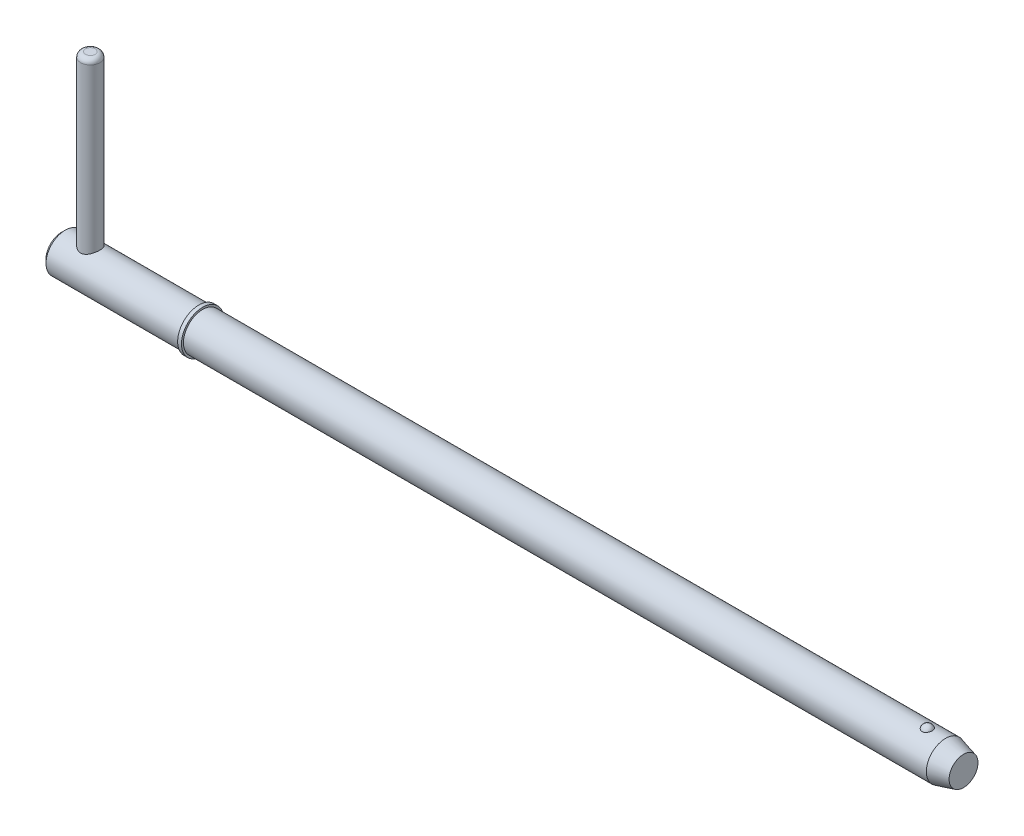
ISO-10303-21;
HEADER;
FILE_DESCRIPTION(('STEP AP214'),'2;1');
FILE_NAME('part.step','',(''),(''),'','','');
FILE_SCHEMA(('AUTOMOTIVE_DESIGN { 1 0 10303 214 1 1 1 1 }'));
ENDSEC;
DATA;
#1=APPLICATION_CONTEXT('core data for automotive mechanical design processes');
#2=APPLICATION_PROTOCOL_DEFINITION('international standard','automotive_design',2000,#1);
#3=PRODUCT_CONTEXT('',#1,'mechanical');
#4=PRODUCT('Part','Part','',(#3));
#5=PRODUCT_RELATED_PRODUCT_CATEGORY('part','',(#4));
#6=PRODUCT_DEFINITION_FORMATION('','',#4);
#7=PRODUCT_DEFINITION_CONTEXT('part definition',#1,'design');
#8=PRODUCT_DEFINITION('design','',#6,#7);
#9=PRODUCT_DEFINITION_SHAPE('','',#8);
#10=(LENGTH_UNIT() NAMED_UNIT(*) SI_UNIT(.MILLI.,.METRE.));
#11=(NAMED_UNIT(*) PLANE_ANGLE_UNIT() SI_UNIT($,.RADIAN.));
#12=(NAMED_UNIT(*) SI_UNIT($,.STERADIAN.) SOLID_ANGLE_UNIT());
#13=UNCERTAINTY_MEASURE_WITH_UNIT(LENGTH_MEASURE(1.E-05),#10,'distance_accuracy_value','');
#14=(GEOMETRIC_REPRESENTATION_CONTEXT(3) GLOBAL_UNCERTAINTY_ASSIGNED_CONTEXT((#13)) GLOBAL_UNIT_ASSIGNED_CONTEXT((#10,
#11,#12)) REPRESENTATION_CONTEXT('',''));
#15=CARTESIAN_POINT('',(0.,0.,0.));
#16=DIRECTION('',(0.,0.,1.));
#17=DIRECTION('',(1.,0.,0.));
#18=AXIS2_PLACEMENT_3D('',#15,#16,#17);
#19=CARTESIAN_POINT('',(3.57,23.02,0.));
#20=DIRECTION('',(0.,-1.,0.));
#21=DIRECTION('',(0.,0.,-1.));
#22=AXIS2_PLACEMENT_3D('',#19,#20,#21);
#23=CYLINDRICAL_SURFACE('',#22,1.19);
#24=CARTESIAN_POINT('',(3.57,-1.785,0.));
#25=DIRECTION('',(0.,1.,0.));
#26=DIRECTION('',(0.,0.,1.));
#27=AXIS2_PLACEMENT_3D('',#24,#25,#26);
#28=CIRCLE('',#27,1.19);
#29=CARTESIAN_POINT('',(3.57,-1.785,1.19));
#30=VERTEX_POINT('',#29);
#31=EDGE_CURVE('P0_E25',#30,#30,#28,.T.);
#32=ORIENTED_EDGE('',*,*,#31,.T.);
#33=EDGE_LOOP('',(#32));
#34=FACE_BOUND('',#33,.T.);
#35=CARTESIAN_POINT('',(3.57,22.425,0.));
#36=DIRECTION('',(0.,1.,0.));
#37=DIRECTION('',(0.,0.,1.));
#38=AXIS2_PLACEMENT_3D('',#35,#36,#37);
#39=CIRCLE('',#38,1.19);
#40=CARTESIAN_POINT('',(3.57,22.425,1.19));
#41=VERTEX_POINT('',#40);
#42=EDGE_CURVE('P0_E29',#41,#41,#39,.F.);
#43=ORIENTED_EDGE('',*,*,#42,.T.);
#44=EDGE_LOOP('',(#43));
#45=FACE_BOUND('',#44,.T.);
#46=ADVANCED_FACE('P0_F14',(#34,#45),#23,.T.);
#47=CARTESIAN_POINT('',(3.57,23.02,0.));
#48=DIRECTION('',(0.,1.,0.));
#49=DIRECTION('',(0.,0.,1.));
#50=AXIS2_PLACEMENT_3D('',#47,#48,#49);
#51=PLANE('',#50);
#52=CARTESIAN_POINT('',(3.57,23.02,0.));
#53=DIRECTION('',(0.,1.,0.));
#54=DIRECTION('',(0.,0.,1.));
#55=AXIS2_PLACEMENT_3D('',#52,#53,#54);
#56=CIRCLE('',#55,0.595);
#57=CARTESIAN_POINT('',(3.57,23.02,0.595));
#58=VERTEX_POINT('',#57);
#59=EDGE_CURVE('P0_E10',#58,#58,#56,.T.);
#60=ORIENTED_EDGE('',*,*,#59,.T.);
#61=EDGE_LOOP('',(#60));
#62=FACE_BOUND('',#61,.T.);
#63=ADVANCED_FACE('P0_F46',(#62),#51,.T.);
#64=CARTESIAN_POINT('',(3.57,-2.38,0.));
#65=DIRECTION('',(0.,1.,0.));
#66=DIRECTION('',(0.,0.,1.));
#67=AXIS2_PLACEMENT_3D('',#64,#65,#66);
#68=PLANE('',#67);
#69=CARTESIAN_POINT('',(3.57,-2.38,0.));
#70=DIRECTION('',(0.,1.,0.));
#71=DIRECTION('',(0.,0.,1.));
#72=AXIS2_PLACEMENT_3D('',#69,#70,#71);
#73=CIRCLE('',#72,0.595);
#74=CARTESIAN_POINT('',(3.57,-2.38,0.595));
#75=VERTEX_POINT('',#74);
#76=EDGE_CURVE('P0_E21',#75,#75,#73,.F.);
#77=ORIENTED_EDGE('',*,*,#76,.T.);
#78=EDGE_LOOP('',(#77));
#79=FACE_BOUND('',#78,.T.);
#80=ADVANCED_FACE('P0_F43',(#79),#68,.F.);
#81=CARTESIAN_POINT('',(3.57,-1.785,0.));
#82=DIRECTION('',(0.,1.,0.));
#83=DIRECTION('',(0.,0.,1.));
#84=AXIS2_PLACEMENT_3D('',#81,#82,#83);
#85=DEGENERATE_TOROIDAL_SURFACE('',#84,0.595,0.595,.T.);
#86=ORIENTED_EDGE('',*,*,#76,.F.);
#87=EDGE_LOOP('',(#86));
#88=FACE_BOUND('',#87,.T.);
#89=ORIENTED_EDGE('',*,*,#31,.F.);
#90=EDGE_LOOP('',(#89));
#91=FACE_BOUND('',#90,.T.);
#92=ADVANCED_FACE('P0_F38',(#88,#91),#85,.T.);
#93=CARTESIAN_POINT('',(3.57,22.425,0.));
#94=DIRECTION('',(0.,1.,0.));
#95=DIRECTION('',(0.,0.,1.));
#96=AXIS2_PLACEMENT_3D('',#93,#94,#95);
#97=DEGENERATE_TOROIDAL_SURFACE('',#96,0.595,0.595,.T.);
#98=ORIENTED_EDGE('',*,*,#42,.F.);
#99=EDGE_LOOP('',(#98));
#100=FACE_BOUND('',#99,.T.);
#101=ORIENTED_EDGE('',*,*,#59,.F.);
#102=EDGE_LOOP('',(#101));
#103=FACE_BOUND('',#102,.T.);
#104=ADVANCED_FACE('P0_F16',(#100,#103),#97,.T.);
#105=CLOSED_SHELL('',(#46,#63,#80,#92,#104));
#106=MANIFOLD_SOLID_BREP('P0_B1',#105);
#107=CARTESIAN_POINT('',(0.,0.,0.));
#108=DIRECTION('',(1.,0.,0.));
#109=DIRECTION('',(0.,0.,-1.));
#110=AXIS2_PLACEMENT_3D('',#107,#108,#109);
#111=CYLINDRICAL_SURFACE('',#110,2.38);
#112=CARTESIAN_POINT('',(109.209429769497,0.,0.));
#113=DIRECTION('',(1.,0.,0.));
#114=DIRECTION('',(0.,0.,-1.));
#115=AXIS2_PLACEMENT_3D('',#112,#113,#114);
#116=CIRCLE('',#115,2.38);
#117=CARTESIAN_POINT('',(109.209429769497,0.,-2.38));
#118=VERTEX_POINT('',#117);
#119=EDGE_CURVE('P1_E81',#118,#118,#116,.T.);
#120=ORIENTED_EDGE('',*,*,#119,.F.);
#121=EDGE_LOOP('',(#120));
#122=FACE_BOUND('',#121,.T.);
#123=CARTESIAN_POINT('',(17.45,0.,0.));
#124=DIRECTION('',(1.,0.,0.));
#125=DIRECTION('',(0.,0.,-1.));
#126=AXIS2_PLACEMENT_3D('',#123,#124,#125);
#127=CIRCLE('',#126,2.38);
#128=CARTESIAN_POINT('',(17.45,0.,-2.38));
#129=VERTEX_POINT('',#128);
#130=EDGE_CURVE('P1_E85',#129,#129,#127,.T.);
#131=ORIENTED_EDGE('',*,*,#130,.T.);
#132=EDGE_LOOP('',(#131));
#133=FACE_BOUND('',#132,.T.);
#134=CARTESIAN_POINT('',(106.963449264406,2.2921568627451,0.640637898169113));
#135=CARTESIAN_POINT('',(106.930355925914,2.29215737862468,0.64063719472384));
#136=CARTESIAN_POINT('',(106.897254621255,2.29293179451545,0.637884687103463));
#137=CARTESIAN_POINT('',(106.832017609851,2.29594030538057,0.626968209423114));
#138=CARTESIAN_POINT('',(106.799882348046,2.29817506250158,0.618801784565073));
#139=CARTESIAN_POINT('',(106.737540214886,2.3038430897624,0.597351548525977));
#140=CARTESIAN_POINT('',(106.70733051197,2.30727454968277,0.584075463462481));
#141=CARTESIAN_POINT('',(106.649567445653,2.31495941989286,0.552829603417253));
#142=CARTESIAN_POINT('',(106.62201418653,2.31921286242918,0.534859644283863));
#143=CARTESIAN_POINT('',(106.569593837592,2.32820213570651,0.494282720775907));
#144=CARTESIAN_POINT('',(106.544805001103,2.33294694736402,0.471576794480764));
#145=CARTESIAN_POINT('',(106.499216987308,2.34234144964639,0.422446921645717));
#146=CARTESIAN_POINT('',(106.478418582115,2.34699112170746,0.396022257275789));
#147=CARTESIAN_POINT('',(106.44035804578,2.35593942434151,0.33885587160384));
#148=CARTESIAN_POINT('',(106.423305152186,2.36021170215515,0.307970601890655));
#149=CARTESIAN_POINT('',(106.3943607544,2.3677057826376,0.243750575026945));
#150=CARTESIAN_POINT('',(106.3824701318,2.37092740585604,0.210415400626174));
#151=CARTESIAN_POINT('',(106.363807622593,2.37606901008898,0.141189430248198));
#152=CARTESIAN_POINT('',(106.357195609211,2.37794816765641,0.105252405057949));
#153=CARTESIAN_POINT('',(106.349809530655,2.38005135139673,0.0327351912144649));
#154=CARTESIAN_POINT('',(106.349035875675,2.38027526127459,-0.00384504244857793));
#155=CARTESIAN_POINT('',(106.353362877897,2.37903842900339,-0.0769838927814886));
#156=CARTESIAN_POINT('',(106.35852028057,2.37756141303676,-0.113538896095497));
#157=CARTESIAN_POINT('',(106.374701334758,2.37305303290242,-0.185229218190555));
#158=CARTESIAN_POINT('',(106.385725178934,2.37002161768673,-0.220364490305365));
#159=CARTESIAN_POINT('',(106.413397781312,2.36273722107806,-0.288156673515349));
#160=CARTESIAN_POINT('',(106.430038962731,2.35848588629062,-0.320816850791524));
#161=CARTESIAN_POINT('',(106.468598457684,2.34923130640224,-0.382744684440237));
#162=CARTESIAN_POINT('',(106.490516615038,2.34422808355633,-0.412012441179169));
#163=CARTESIAN_POINT('',(106.538754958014,2.33412555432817,-0.465830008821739));
#164=CARTESIAN_POINT('',(106.565002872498,2.32902887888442,-0.490444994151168));
#165=CARTESIAN_POINT('',(106.621476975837,2.31926941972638,-0.534700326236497));
#166=CARTESIAN_POINT('',(106.651702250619,2.3146065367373,-0.554341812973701));
#167=CARTESIAN_POINT('',(106.714061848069,2.30645675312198,-0.587312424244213));
#168=CARTESIAN_POINT('',(106.746078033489,2.30293152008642,-0.600855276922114));
#169=CARTESIAN_POINT('',(106.812079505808,2.29725171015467,-0.622220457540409));
#170=CARTESIAN_POINT('',(106.846064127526,2.29509667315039,-0.630044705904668));
#171=CARTESIAN_POINT('',(106.913299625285,2.29249264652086,-0.639452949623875));
#172=CARTESIAN_POINT('',(106.946508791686,2.29196755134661,-0.641315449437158));
#173=CARTESIAN_POINT('',(107.012763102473,2.29246849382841,-0.63952261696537));
#174=CARTESIAN_POINT('',(107.045808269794,2.29349430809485,-0.635868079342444));
#175=CARTESIAN_POINT('',(107.110102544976,2.29694059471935,-0.623301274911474));
#176=CARTESIAN_POINT('',(107.141374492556,2.29933234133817,-0.614497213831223));
#177=CARTESIAN_POINT('',(107.201995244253,2.30522511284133,-0.592006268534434));
#178=CARTESIAN_POINT('',(107.231343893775,2.30872622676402,-0.578318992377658));
#179=CARTESIAN_POINT('',(107.288036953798,2.31655795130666,-0.546112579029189));
#180=CARTESIAN_POINT('',(107.315320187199,2.32090569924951,-0.52749010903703));
#181=CARTESIAN_POINT('',(107.366490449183,2.3299220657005,-0.486117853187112));
#182=CARTESIAN_POINT('',(107.390376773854,2.33459075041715,-0.463367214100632));
#183=CARTESIAN_POINT('',(107.435272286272,2.34399834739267,-0.41322006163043));
#184=CARTESIAN_POINT('',(107.456097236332,2.34873051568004,-0.38565730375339));
#185=CARTESIAN_POINT('',(107.493056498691,2.35754932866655,-0.327455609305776));
#186=CARTESIAN_POINT('',(107.509189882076,2.36163584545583,-0.296816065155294));
#187=CARTESIAN_POINT('',(107.5369822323,2.36889321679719,-0.232047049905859));
#188=CARTESIAN_POINT('',(107.548445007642,2.37202275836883,-0.197828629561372));
#189=CARTESIAN_POINT('',(107.565752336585,2.37681926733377,-0.127900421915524));
#190=CARTESIAN_POINT('',(107.571596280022,2.37848607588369,-0.092190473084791));
#191=CARTESIAN_POINT('',(107.577605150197,2.38020024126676,-0.0196348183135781));
#192=CARTESIAN_POINT('',(107.57767043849,2.38021918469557,0.0172198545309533));
#193=CARTESIAN_POINT('',(107.571868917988,2.37856356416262,0.0904219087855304));
#194=CARTESIAN_POINT('',(107.566001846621,2.37688892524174,0.126769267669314));
#195=CARTESIAN_POINT('',(107.548425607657,2.37201688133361,0.198028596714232));
#196=CARTESIAN_POINT('',(107.536699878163,2.36881516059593,0.232936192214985));
#197=CARTESIAN_POINT('',(107.50763544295,2.36123444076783,0.300196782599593));
#198=CARTESIAN_POINT('',(107.490296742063,2.3568554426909,0.332549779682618));
#199=CARTESIAN_POINT('',(107.450535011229,2.34744667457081,0.39349541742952));
#200=CARTESIAN_POINT('',(107.428152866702,2.34242227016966,0.422115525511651));
#201=CARTESIAN_POINT('',(107.378739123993,2.33227293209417,0.475004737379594));
#202=CARTESIAN_POINT('',(107.351707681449,2.32714800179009,0.499273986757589));
#203=CARTESIAN_POINT('',(107.294498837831,2.31755359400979,0.542046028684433));
#204=CARTESIAN_POINT('',(107.26442973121,2.3130698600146,0.560690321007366));
#205=CARTESIAN_POINT('',(107.201386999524,2.30514125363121,0.592447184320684));
#206=CARTESIAN_POINT('',(107.168415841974,2.30169550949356,0.605564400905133));
#207=CARTESIAN_POINT('',(107.106842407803,2.29677744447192,0.623927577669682));
#208=CARTESIAN_POINT('',(107.078555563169,2.295058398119,0.630178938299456));
#209=CARTESIAN_POINT('',(107.021330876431,2.29274795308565,0.638534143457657));
#210=CARTESIAN_POINT('',(106.992393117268,2.29215641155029,0.640638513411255));
#211=CARTESIAN_POINT('',(106.963449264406,2.2921568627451,0.640637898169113));
#212=B_SPLINE_CURVE_WITH_KNOTS('',3,(#134,#135,#136,#137,#138,#139,#140,#141,#142,#143,#144,
#145,#146,#147,#148,#149,#150,#151,#152,#153,#154,#155,#156,#157,#158,#159,#160,#161,#162,#163,
#164,#165,#166,#167,#168,#169,#170,#171,#172,#173,#174,#175,#176,#177,#178,#179,#180,#181,#182,
#183,#184,#185,#186,#187,#188,#189,#190,#191,#192,#193,#194,#195,#196,#197,#198,#199,#200,#201,
#202,#203,#204,#205,#206,#207,#208,#209,#210,#211),.UNSPECIFIED.,.T.,.F.,(4,2,2,2,2,2,2,2,2,2,2,
2,2,2,2,2,2,2,2,2,2,2,2,2,2,2,2,2,2,2,2,2,2,2,2,2,2,2,4),(0.,0.0991724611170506,
0.198389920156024,0.297457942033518,0.396529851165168,0.497927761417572,0.59934527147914,
0.705475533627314,0.811623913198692,0.920876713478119,1.03013718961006,1.14045177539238,
1.25076998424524,1.36093998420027,1.47110672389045,1.57959248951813,1.68805336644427,
1.79234266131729,1.89659691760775,1.9959039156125,2.09519661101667,2.19247425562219,
2.2897597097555,2.38926978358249,2.48880044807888,2.59293588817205,2.69709193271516,
2.80525821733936,2.91343624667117,3.0234791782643,3.13352698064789,3.24388765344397,
3.35424823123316,3.46374443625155,3.5732369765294,3.67968690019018,3.78604717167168,
3.87279565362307,3.9595331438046),.UNSPECIFIED.);
#213=CARTESIAN_POINT('',(106.963449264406,2.2921568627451,0.640637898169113));
#214=VERTEX_POINT('',#213);
#215=EDGE_CURVE('P1_E35',#214,#214,#212,.T.);
#216=ORIENTED_EDGE('',*,*,#215,.T.);
#217=EDGE_LOOP('',(#216));
#218=FACE_BOUND('',#217,.T.);
#219=ADVANCED_FACE('P1_F13',(#122,#133,#218),#111,.T.);
#220=CARTESIAN_POINT('',(0.,0.,0.));
#221=DIRECTION('',(-1.,0.,0.));
#222=DIRECTION('',(0.,0.,1.));
#223=AXIS2_PLACEMENT_3D('',#220,#221,#222);
#224=PLANE('',#223);
#225=CARTESIAN_POINT('',(0.,0.,0.));
#226=DIRECTION('',(1.,0.,0.));
#227=DIRECTION('',(0.,0.,-1.));
#228=AXIS2_PLACEMENT_3D('',#225,#226,#227);
#229=CIRCLE('',#228,1.904);
#230=CARTESIAN_POINT('',(0.,0.,-1.904));
#231=VERTEX_POINT('',#230);
#232=EDGE_CURVE('P1_E9',#231,#231,#229,.T.);
#233=ORIENTED_EDGE('',*,*,#232,.F.);
#234=EDGE_LOOP('',(#233));
#235=FACE_BOUND('',#234,.T.);
#236=ADVANCED_FACE('P1_F15',(#235),#224,.T.);
#237=CARTESIAN_POINT('',(0.475999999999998,0.,0.));
#238=DIRECTION('',(1.,0.,0.));
#239=DIRECTION('',(0.,0.,-1.));
#240=AXIS2_PLACEMENT_3D('',#237,#238,#239);
#241=CONICAL_SURFACE('',#240,2.38,0.78539816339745);
#242=ORIENTED_EDGE('',*,*,#232,.T.);
#243=EDGE_LOOP('',(#242));
#244=FACE_BOUND('',#243,.T.);
#245=CARTESIAN_POINT('',(0.475999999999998,0.,0.));
#246=DIRECTION('',(1.,0.,0.));
#247=DIRECTION('',(0.,0.,-1.));
#248=AXIS2_PLACEMENT_3D('',#245,#246,#247);
#249=CIRCLE('',#248,2.38);
#250=CARTESIAN_POINT('',(0.475999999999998,0.,-2.38));
#251=VERTEX_POINT('',#250);
#252=EDGE_CURVE('P1_E26',#251,#251,#249,.T.);
#253=ORIENTED_EDGE('',*,*,#252,.F.);
#254=EDGE_LOOP('',(#253));
#255=FACE_BOUND('',#254,.T.);
#256=ADVANCED_FACE('P1_F77',(#244,#255),#241,.T.);
#257=CARTESIAN_POINT('',(0.,0.,0.));
#258=DIRECTION('',(1.,0.,0.));
#259=DIRECTION('',(0.,0.,-1.));
#260=AXIS2_PLACEMENT_3D('',#257,#258,#259);
#261=CYLINDRICAL_SURFACE('',#260,2.38);
#262=CARTESIAN_POINT('',(3.57,-2.06114046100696,1.19));
#263=CARTESIAN_POINT('',(3.50799170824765,-2.06114586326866,1.18999567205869));
#264=CARTESIAN_POINT('',(3.4459051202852,-2.0639812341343,1.18512096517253));
#265=CARTESIAN_POINT('',(3.32363755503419,-2.07491216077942,1.16587061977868));
#266=CARTESIAN_POINT('',(3.26346086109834,-2.08301876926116,1.15147501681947));
#267=CARTESIAN_POINT('',(3.14701251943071,-2.10331722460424,1.11395893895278));
#268=CARTESIAN_POINT('',(3.09072196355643,-2.1154873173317,1.09088484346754));
#269=CARTESIAN_POINT('',(2.9828251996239,-2.14250771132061,1.03680835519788));
#270=CARTESIAN_POINT('',(2.93121924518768,-2.15735815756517,1.00580553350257));
#271=CARTESIAN_POINT('',(2.82945618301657,-2.18956274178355,0.933753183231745));
#272=CARTESIAN_POINT('',(2.77976962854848,-2.20702235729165,0.892085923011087));
#273=CARTESIAN_POINT('',(2.68772401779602,-2.2416265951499,0.801172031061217));
#274=CARTESIAN_POINT('',(2.64536861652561,-2.25877105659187,0.751921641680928));
#275=CARTESIAN_POINT('',(2.56639309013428,-2.29219557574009,0.64318258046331));
#276=CARTESIAN_POINT('',(2.53035201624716,-2.30833946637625,0.583227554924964));
#277=CARTESIAN_POINT('',(2.46908238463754,-2.3365739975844,0.45714686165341));
#278=CARTESIAN_POINT('',(2.44384700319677,-2.34866719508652,0.391025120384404));
#279=CARTESIAN_POINT('',(2.40676945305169,-2.36667748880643,0.259473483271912));
#280=CARTESIAN_POINT('',(2.39410206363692,-2.37297281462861,0.194329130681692));
#281=CARTESIAN_POINT('',(2.3798023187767,-2.3800902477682,0.0625590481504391));
#282=CARTESIAN_POINT('',(2.37816328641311,-2.38091566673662,-0.00406576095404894));
#283=CARTESIAN_POINT('',(2.38564854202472,-2.37717948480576,-0.130700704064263));
#284=CARTESIAN_POINT('',(2.39384923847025,-2.37308010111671,-0.190782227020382));
#285=CARTESIAN_POINT('',(2.41912820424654,-2.360653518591,-0.308583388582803));
#286=CARTESIAN_POINT('',(2.43620713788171,-2.35232600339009,-0.366302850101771));
#287=CARTESIAN_POINT('',(2.47886825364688,-2.33206184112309,-0.478748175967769));
#288=CARTESIAN_POINT('',(2.50456481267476,-2.32007685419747,-0.533421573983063));
#289=CARTESIAN_POINT('',(2.56357346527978,-2.29357798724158,-0.637812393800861));
#290=CARTESIAN_POINT('',(2.5968882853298,-2.27906320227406,-0.687528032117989));
#291=CARTESIAN_POINT('',(2.67380546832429,-2.24724829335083,-0.785606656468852));
#292=CARTESIAN_POINT('',(2.71808260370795,-2.22981457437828,-0.833397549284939));
#293=CARTESIAN_POINT('',(2.81386177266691,-2.19500665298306,-0.921184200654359));
#294=CARTESIAN_POINT('',(2.86536931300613,-2.17763250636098,-0.961173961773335));
#295=CARTESIAN_POINT('',(2.97815134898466,-2.14371545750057,-1.03471134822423));
#296=CARTESIAN_POINT('',(3.03983836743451,-2.12729540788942,-1.06768860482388));
#297=CARTESIAN_POINT('',(3.16889582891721,-2.09886785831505,-1.12254974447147));
#298=CARTESIAN_POINT('',(3.2362602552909,-2.0868557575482,-1.14444520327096));
#299=CARTESIAN_POINT('',(3.36914526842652,-2.06994116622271,-1.1747444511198));
#300=CARTESIAN_POINT('',(3.43438893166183,-2.06455070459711,-1.18407989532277));
#301=CARTESIAN_POINT('',(3.56571759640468,-2.06010324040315,-1.1918051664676));
#302=CARTESIAN_POINT('',(3.63180197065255,-2.06104176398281,-1.19020272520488));
#303=CARTESIAN_POINT('',(3.75522816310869,-2.06862860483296,-1.17695289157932));
#304=CARTESIAN_POINT('',(3.81273554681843,-2.07464109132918,-1.16642350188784));
#305=CARTESIAN_POINT('',(3.92505766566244,-2.09075885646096,-1.1372785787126));
#306=CARTESIAN_POINT('',(3.97987152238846,-2.1008654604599,-1.1186604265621));
#307=CARTESIAN_POINT('',(4.08813948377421,-2.12458104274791,-1.07296063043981));
#308=CARTESIAN_POINT('',(4.14141303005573,-2.13833055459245,-1.04552693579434));
#309=CARTESIAN_POINT('',(4.2429084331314,-2.16765782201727,-0.983281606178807));
#310=CARTESIAN_POINT('',(4.29112767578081,-2.18323651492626,-0.948466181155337));
#311=CARTESIAN_POINT('',(4.38750473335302,-2.2168271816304,-0.867316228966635));
#312=CARTESIAN_POINT('',(4.43488860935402,-2.23489833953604,-0.82008287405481));
#313=CARTESIAN_POINT('',(4.52130056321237,-2.26973739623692,-0.718051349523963));
#314=CARTESIAN_POINT('',(4.56032581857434,-2.28650485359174,-0.663250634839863));
#315=CARTESIAN_POINT('',(4.62978273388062,-2.31742220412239,-0.545657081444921));
#316=CARTESIAN_POINT('',(4.65996041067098,-2.33149133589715,-0.482691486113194));
#317=CARTESIAN_POINT('',(4.7089941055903,-2.35481192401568,-0.351671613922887));
#318=CARTESIAN_POINT('',(4.7278600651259,-2.36406760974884,-0.283621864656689));
#319=CARTESIAN_POINT('',(4.75210859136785,-2.3760433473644,-0.151105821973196));
#320=CARTESIAN_POINT('',(4.75856947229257,-2.37928514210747,-0.0868836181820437));
#321=CARTESIAN_POINT('',(4.76100348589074,-2.38050135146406,0.0417999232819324));
#322=CARTESIAN_POINT('',(4.75698028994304,-2.37847760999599,0.106261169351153));
#323=CARTESIAN_POINT('',(4.73927447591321,-2.36969422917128,0.229120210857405));
#324=CARTESIAN_POINT('',(4.72624582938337,-2.36325544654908,0.287637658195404));
#325=CARTESIAN_POINT('',(4.69178087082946,-2.34658591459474,0.401560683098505));
#326=CARTESIAN_POINT('',(4.67034335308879,-2.33635462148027,0.456965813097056));
#327=CARTESIAN_POINT('',(4.61871480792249,-2.31247857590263,0.565753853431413));
#328=CARTESIAN_POINT('',(4.58818860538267,-2.29870654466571,0.618948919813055));
#329=CARTESIAN_POINT('',(4.51967006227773,-2.26918878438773,0.719681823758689));
#330=CARTESIAN_POINT('',(4.48167429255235,-2.25344215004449,0.76721704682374));
#331=CARTESIAN_POINT('',(4.39491140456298,-2.21969046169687,0.860267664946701));
#332=CARTESIAN_POINT('',(4.34544863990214,-2.20161660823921,0.905111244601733));
#333=CARTESIAN_POINT('',(4.23943364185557,-2.16655060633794,0.986109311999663));
#334=CARTESIAN_POINT('',(4.18287520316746,-2.1495594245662,1.02225611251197));
#335=CARTESIAN_POINT('',(4.06190239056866,-2.1181953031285,1.08579298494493));
#336=CARTESIAN_POINT('',(3.9972962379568,-2.10392207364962,1.11287022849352));
#337=CARTESIAN_POINT('',(3.86353443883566,-2.08090726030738,1.15534566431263));
#338=CARTESIAN_POINT('',(3.7943948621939,-2.07214719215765,1.17078291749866));
#339=CARTESIAN_POINT('',(3.69875162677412,-2.06499834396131,1.18329673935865));
#340=CARTESIAN_POINT('',(3.67309220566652,-2.06355673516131,1.18580656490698));
#341=CARTESIAN_POINT('',(3.62162638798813,-2.06162663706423,1.18915915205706));
#342=CARTESIAN_POINT('',(3.59581998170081,-2.0611382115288,1.19000180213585));
#343=CARTESIAN_POINT('',(3.57,-2.06114046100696,1.19));
#344=B_SPLINE_CURVE_WITH_KNOTS('',3,(#262,#263,#264,#265,#266,#267,#268,#269,#270,#271,#272,
#273,#274,#275,#276,#277,#278,#279,#280,#281,#282,#283,#284,#285,#286,#287,#288,#289,#290,#291,
#292,#293,#294,#295,#296,#297,#298,#299,#300,#301,#302,#303,#304,#305,#306,#307,#308,#309,#310,
#311,#312,#313,#314,#315,#316,#317,#318,#319,#320,#321,#322,#323,#324,#325,#326,#327,#328,#329,
#330,#331,#332,#333,#334,#335,#336,#337,#338,#339,#340,#341,#342,#343),.UNSPECIFIED.,.T.,.F.,(4,
2,2,2,2,2,2,2,2,2,2,2,2,2,2,2,2,2,2,2,2,2,2,2,2,2,2,2,2,2,2,2,2,2,2,2,2,2,2,2,4),(0.,
0.185916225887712,0.372223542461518,0.557549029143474,0.742884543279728,0.943506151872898,
1.14422749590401,1.35847891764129,1.5725948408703,1.77147547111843,1.97023568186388,
2.15171156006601,2.33320101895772,2.51720146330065,2.70126786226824,2.902733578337,
3.10435357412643,3.31877721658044,3.53297641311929,3.73020126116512,3.92728670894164,
4.1028127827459,4.27839572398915,4.46211082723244,4.64592048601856,4.8529002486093,
5.0599497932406,5.27246375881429,5.48479067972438,5.67763601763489,5.87041383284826,
6.05048865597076,6.23058930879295,6.41839293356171,6.60628297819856,6.8128718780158,
7.01964271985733,7.2329479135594,7.44553408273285,7.52294360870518,7.60035831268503),.UNSPECIFIED.);
#345=CARTESIAN_POINT('',(3.57,-2.06114046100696,1.19));
#346=VERTEX_POINT('',#345);
#347=EDGE_CURVE('P1_E17',#346,#346,#344,.T.);
#348=ORIENTED_EDGE('',*,*,#347,.F.);
#349=EDGE_LOOP('',(#348));
#350=FACE_BOUND('',#349,.T.);
#351=CARTESIAN_POINT('',(3.57,2.06114046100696,1.19));
#352=CARTESIAN_POINT('',(3.63200829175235,2.06114586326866,1.18999567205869));
#353=CARTESIAN_POINT('',(3.6940948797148,2.0639812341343,1.18512096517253));
#354=CARTESIAN_POINT('',(3.81636244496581,2.07491216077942,1.16587061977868));
#355=CARTESIAN_POINT('',(3.87653913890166,2.08301876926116,1.15147501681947));
#356=CARTESIAN_POINT('',(3.99298748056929,2.10331722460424,1.11395893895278));
#357=CARTESIAN_POINT('',(4.04927803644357,2.1154873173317,1.09088484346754));
#358=CARTESIAN_POINT('',(4.1571748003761,2.14250771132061,1.03680835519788));
#359=CARTESIAN_POINT('',(4.20878075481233,2.15735815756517,1.00580553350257));
#360=CARTESIAN_POINT('',(4.31054381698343,2.18956274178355,0.933753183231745));
#361=CARTESIAN_POINT('',(4.36023037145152,2.20702235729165,0.892085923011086));
#362=CARTESIAN_POINT('',(4.45227598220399,2.2416265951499,0.801172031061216));
#363=CARTESIAN_POINT('',(4.49463138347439,2.25877105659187,0.751921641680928));
#364=CARTESIAN_POINT('',(4.57360690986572,2.29219557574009,0.643182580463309));
#365=CARTESIAN_POINT('',(4.60964798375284,2.30833946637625,0.583227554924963));
#366=CARTESIAN_POINT('',(4.67091761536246,2.3365739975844,0.457146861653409));
#367=CARTESIAN_POINT('',(4.69615299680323,2.34866719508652,0.391025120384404));
#368=CARTESIAN_POINT('',(4.73323054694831,2.36667748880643,0.259473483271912));
#369=CARTESIAN_POINT('',(4.74589793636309,2.37297281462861,0.194329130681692));
#370=CARTESIAN_POINT('',(4.7601976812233,2.3800902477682,0.0625590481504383));
#371=CARTESIAN_POINT('',(4.76183671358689,2.38091566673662,-0.00406576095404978));
#372=CARTESIAN_POINT('',(4.75435145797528,2.37717948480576,-0.130700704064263));
#373=CARTESIAN_POINT('',(4.74615076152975,2.37308010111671,-0.190782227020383));
#374=CARTESIAN_POINT('',(4.72087179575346,2.360653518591,-0.308583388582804));
#375=CARTESIAN_POINT('',(4.70379286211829,2.35232600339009,-0.366302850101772));
#376=CARTESIAN_POINT('',(4.66113174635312,2.33206184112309,-0.478748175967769));
#377=CARTESIAN_POINT('',(4.63543518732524,2.32007685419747,-0.533421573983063));
#378=CARTESIAN_POINT('',(4.57642653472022,2.29357798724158,-0.637812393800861));
#379=CARTESIAN_POINT('',(4.5431117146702,2.27906320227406,-0.687528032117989));
#380=CARTESIAN_POINT('',(4.46619453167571,2.24724829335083,-0.785606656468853));
#381=CARTESIAN_POINT('',(4.42191739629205,2.22981457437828,-0.83339754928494));
#382=CARTESIAN_POINT('',(4.32613822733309,2.19500665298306,-0.921184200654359));
#383=CARTESIAN_POINT('',(4.27463068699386,2.17763250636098,-0.961173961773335));
#384=CARTESIAN_POINT('',(4.16184865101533,2.14371545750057,-1.03471134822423));
#385=CARTESIAN_POINT('',(4.10016163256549,2.12729540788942,-1.06768860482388));
#386=CARTESIAN_POINT('',(3.97110417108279,2.09886785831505,-1.12254974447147));
#387=CARTESIAN_POINT('',(3.9037397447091,2.0868557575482,-1.14444520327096));
#388=CARTESIAN_POINT('',(3.77085473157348,2.06994116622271,-1.1747444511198));
#389=CARTESIAN_POINT('',(3.70561106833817,2.06455070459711,-1.18407989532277));
#390=CARTESIAN_POINT('',(3.57428240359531,2.06010324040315,-1.1918051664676));
#391=CARTESIAN_POINT('',(3.50819802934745,2.06104176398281,-1.19020272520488));
#392=CARTESIAN_POINT('',(3.38477183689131,2.06862860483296,-1.17695289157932));
#393=CARTESIAN_POINT('',(3.32726445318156,2.07464109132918,-1.16642350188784));
#394=CARTESIAN_POINT('',(3.21494233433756,2.09075885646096,-1.1372785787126));
#395=CARTESIAN_POINT('',(3.16012847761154,2.1008654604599,-1.1186604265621));
#396=CARTESIAN_POINT('',(3.05186051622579,2.12458104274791,-1.07296063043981));
#397=CARTESIAN_POINT('',(2.99858696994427,2.13833055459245,-1.04552693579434));
#398=CARTESIAN_POINT('',(2.8970915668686,2.16765782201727,-0.983281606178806));
#399=CARTESIAN_POINT('',(2.84887232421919,2.18323651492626,-0.948466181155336));
#400=CARTESIAN_POINT('',(2.75249526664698,2.2168271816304,-0.867316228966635));
#401=CARTESIAN_POINT('',(2.70511139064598,2.23489833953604,-0.820082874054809));
#402=CARTESIAN_POINT('',(2.61869943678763,2.26973739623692,-0.718051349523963));
#403=CARTESIAN_POINT('',(2.57967418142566,2.28650485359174,-0.663250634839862));
#404=CARTESIAN_POINT('',(2.51021726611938,2.31742220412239,-0.54565708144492));
#405=CARTESIAN_POINT('',(2.48003958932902,2.33149133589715,-0.482691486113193));
#406=CARTESIAN_POINT('',(2.4310058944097,2.35481192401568,-0.351671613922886));
#407=CARTESIAN_POINT('',(2.4121399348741,2.36406760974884,-0.283621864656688));
#408=CARTESIAN_POINT('',(2.38789140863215,2.3760433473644,-0.151105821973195));
#409=CARTESIAN_POINT('',(2.38143052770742,2.37928514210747,-0.0868836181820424));
#410=CARTESIAN_POINT('',(2.37899651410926,2.38050135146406,0.0417999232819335));
#411=CARTESIAN_POINT('',(2.38301971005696,2.37847760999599,0.106261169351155));
#412=CARTESIAN_POINT('',(2.40072552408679,2.36969422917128,0.229120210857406));
#413=CARTESIAN_POINT('',(2.41375417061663,2.36325544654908,0.287637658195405));
#414=CARTESIAN_POINT('',(2.44821912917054,2.34658591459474,0.401560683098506));
#415=CARTESIAN_POINT('',(2.46965664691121,2.33635462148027,0.456965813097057));
#416=CARTESIAN_POINT('',(2.52128519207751,2.31247857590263,0.565753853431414));
#417=CARTESIAN_POINT('',(2.55181139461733,2.29870654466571,0.618948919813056));
#418=CARTESIAN_POINT('',(2.62032993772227,2.26918878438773,0.719681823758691));
#419=CARTESIAN_POINT('',(2.65832570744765,2.25344215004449,0.767217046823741));
#420=CARTESIAN_POINT('',(2.74508859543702,2.21969046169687,0.860267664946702));
#421=CARTESIAN_POINT('',(2.79455136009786,2.20161660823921,0.905111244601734));
#422=CARTESIAN_POINT('',(2.90056635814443,2.16655060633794,0.986109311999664));
#423=CARTESIAN_POINT('',(2.95712479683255,2.1495594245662,1.02225611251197));
#424=CARTESIAN_POINT('',(3.07809760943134,2.1181953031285,1.08579298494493));
#425=CARTESIAN_POINT('',(3.1427037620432,2.10392207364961,1.11287022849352));
#426=CARTESIAN_POINT('',(3.27646556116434,2.08090726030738,1.15534566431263));
#427=CARTESIAN_POINT('',(3.3456051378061,2.07214719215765,1.17078291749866));
#428=CARTESIAN_POINT('',(3.44124837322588,2.06499834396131,1.18329673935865));
#429=CARTESIAN_POINT('',(3.46690779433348,2.06355673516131,1.18580656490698));
#430=CARTESIAN_POINT('',(3.51837361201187,2.06162663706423,1.18915915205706));
#431=CARTESIAN_POINT('',(3.54418001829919,2.0611382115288,1.19000180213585));
#432=CARTESIAN_POINT('',(3.57,2.06114046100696,1.19));
#433=B_SPLINE_CURVE_WITH_KNOTS('',3,(#351,#352,#353,#354,#355,#356,#357,#358,#359,#360,#361,
#362,#363,#364,#365,#366,#367,#368,#369,#370,#371,#372,#373,#374,#375,#376,#377,#378,#379,#380,
#381,#382,#383,#384,#385,#386,#387,#388,#389,#390,#391,#392,#393,#394,#395,#396,#397,#398,#399,
#400,#401,#402,#403,#404,#405,#406,#407,#408,#409,#410,#411,#412,#413,#414,#415,#416,#417,#418,
#419,#420,#421,#422,#423,#424,#425,#426,#427,#428,#429,#430,#431,#432),.UNSPECIFIED.,.T.,.F.,(4,
2,2,2,2,2,2,2,2,2,2,2,2,2,2,2,2,2,2,2,2,2,2,2,2,2,2,2,2,2,2,2,2,2,2,2,2,2,2,2,4),(0.,
0.185916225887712,0.372223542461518,0.557549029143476,0.74288454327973,0.9435061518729,
1.14422749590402,1.35847891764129,1.5725948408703,1.77147547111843,1.97023568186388,
2.15171156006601,2.33320101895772,2.51720146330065,2.70126786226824,2.902733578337,
3.10435357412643,3.31877721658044,3.53297641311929,3.73020126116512,3.92728670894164,
4.1028127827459,4.27839572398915,4.46211082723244,4.64592048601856,4.8529002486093,
5.05994979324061,5.27246375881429,5.48479067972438,5.67763601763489,5.87041383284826,
6.05048865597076,6.23058930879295,6.41839293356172,6.60628297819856,6.8128718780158,
7.01964271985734,7.2329479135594,7.44553408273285,7.52294360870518,7.60035831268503),.UNSPECIFIED.);
#434=CARTESIAN_POINT('',(3.57,2.06114046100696,1.19));
#435=VERTEX_POINT('',#434);
#436=EDGE_CURVE('P1_E43',#435,#435,#433,.T.);
#437=ORIENTED_EDGE('',*,*,#436,.F.);
#438=EDGE_LOOP('',(#437));
#439=FACE_BOUND('',#438,.T.);
#440=ORIENTED_EDGE('',*,*,#252,.T.);
#441=EDGE_LOOP('',(#440));
#442=FACE_BOUND('',#441,.T.);
#443=CARTESIAN_POINT('',(16.974,0.,0.));
#444=DIRECTION('',(1.,0.,0.));
#445=DIRECTION('',(0.,0.,-1.));
#446=AXIS2_PLACEMENT_3D('',#443,#444,#445);
#447=CIRCLE('',#446,2.38);
#448=CARTESIAN_POINT('',(16.974,0.,-2.38));
#449=VERTEX_POINT('',#448);
#450=EDGE_CURVE('P1_E31',#449,#449,#447,.T.);
#451=ORIENTED_EDGE('',*,*,#450,.F.);
#452=EDGE_LOOP('',(#451));
#453=FACE_BOUND('',#452,.T.);
#454=ADVANCED_FACE('P1_F103',(#350,#439,#442,#453),#261,.T.);
#455=CARTESIAN_POINT('',(16.974,2.38,0.));
#456=DIRECTION('',(-1.,0.,0.));
#457=DIRECTION('',(0.,0.,1.));
#458=AXIS2_PLACEMENT_3D('',#455,#456,#457);
#459=PLANE('',#458);
#460=ORIENTED_EDGE('',*,*,#450,.T.);
#461=EDGE_LOOP('',(#460));
#462=FACE_BOUND('',#461,.T.);
#463=CARTESIAN_POINT('',(16.974,0.,0.));
#464=DIRECTION('',(1.,0.,0.));
#465=DIRECTION('',(0.,0.,-1.));
#466=AXIS2_PLACEMENT_3D('',#463,#464,#465);
#467=CIRCLE('',#466,2.618);
#468=CARTESIAN_POINT('',(16.974,0.,-2.618));
#469=VERTEX_POINT('',#468);
#470=EDGE_CURVE('P1_E91',#469,#469,#467,.T.);
#471=ORIENTED_EDGE('',*,*,#470,.F.);
#472=EDGE_LOOP('',(#471));
#473=FACE_BOUND('',#472,.T.);
#474=ADVANCED_FACE('P1_F100',(#462,#473),#459,.T.);
#475=CARTESIAN_POINT('',(0.,0.,0.));
#476=DIRECTION('',(1.,0.,0.));
#477=DIRECTION('',(0.,0.,-1.));
#478=AXIS2_PLACEMENT_3D('',#475,#476,#477);
#479=CYLINDRICAL_SURFACE('',#478,2.618);
#480=ORIENTED_EDGE('',*,*,#470,.T.);
#481=EDGE_LOOP('',(#480));
#482=FACE_BOUND('',#481,.T.);
#483=CARTESIAN_POINT('',(17.45,0.,0.));
#484=DIRECTION('',(1.,0.,0.));
#485=DIRECTION('',(0.,0.,-1.));
#486=AXIS2_PLACEMENT_3D('',#483,#484,#485);
#487=CIRCLE('',#486,2.618);
#488=CARTESIAN_POINT('',(17.45,0.,-2.618));
#489=VERTEX_POINT('',#488);
#490=EDGE_CURVE('P1_E88',#489,#489,#487,.T.);
#491=ORIENTED_EDGE('',*,*,#490,.F.);
#492=EDGE_LOOP('',(#491));
#493=FACE_BOUND('',#492,.T.);
#494=ADVANCED_FACE('P1_F68',(#482,#493),#479,.T.);
#495=CARTESIAN_POINT('',(17.45,2.618,0.));
#496=DIRECTION('',(1.,0.,0.));
#497=DIRECTION('',(0.,0.,-1.));
#498=AXIS2_PLACEMENT_3D('',#495,#496,#497);
#499=PLANE('',#498);
#500=ORIENTED_EDGE('',*,*,#490,.T.);
#501=EDGE_LOOP('',(#500));
#502=FACE_BOUND('',#501,.T.);
#503=ORIENTED_EDGE('',*,*,#130,.F.);
#504=EDGE_LOOP('',(#503));
#505=FACE_BOUND('',#504,.T.);
#506=ADVANCED_FACE('P1_F62',(#502,#505),#499,.T.);
#507=CARTESIAN_POINT('',(111.43,0.,0.));
#508=DIRECTION('',(-1.,0.,0.));
#509=DIRECTION('',(0.,0.,1.));
#510=AXIS2_PLACEMENT_3D('',#507,#508,#509);
#511=CONICAL_SURFACE('',#510,1.78500000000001,0.261799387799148);
#512=ORIENTED_EDGE('',*,*,#119,.T.);
#513=EDGE_LOOP('',(#512));
#514=FACE_BOUND('',#513,.T.);
#515=CARTESIAN_POINT('',(111.43,0.,0.));
#516=DIRECTION('',(1.,0.,0.));
#517=DIRECTION('',(0.,0.,-1.));
#518=AXIS2_PLACEMENT_3D('',#515,#516,#517);
#519=CIRCLE('',#518,1.78500000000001);
#520=CARTESIAN_POINT('',(111.43,0.,-1.78500000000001));
#521=VERTEX_POINT('',#520);
#522=EDGE_CURVE('P1_E42',#521,#521,#519,.T.);
#523=ORIENTED_EDGE('',*,*,#522,.F.);
#524=EDGE_LOOP('',(#523));
#525=FACE_BOUND('',#524,.T.);
#526=ADVANCED_FACE('P1_F59',(#514,#525),#511,.T.);
#527=CARTESIAN_POINT('',(111.43,1.78500000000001,0.));
#528=DIRECTION('',(1.,0.,0.));
#529=DIRECTION('',(0.,0.,-1.));
#530=AXIS2_PLACEMENT_3D('',#527,#528,#529);
#531=PLANE('',#530);
#532=ORIENTED_EDGE('',*,*,#522,.T.);
#533=EDGE_LOOP('',(#532));
#534=FACE_BOUND('',#533,.T.);
#535=ADVANCED_FACE('P1_F55',(#534),#531,.T.);
#536=CARTESIAN_POINT('',(106.963449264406,2.142,0.));
#537=DIRECTION('',(-1.,0.,0.));
#538=DIRECTION('',(0.,1.,0.));
#539=AXIS2_PLACEMENT_3D('',#536,#537,#538);
#540=SPHERICAL_SURFACE('',#539,0.657999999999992);
#541=ORIENTED_EDGE('',*,*,#215,.F.);
#542=EDGE_LOOP('',(#541));
#543=FACE_BOUND('',#542,.T.);
#544=ADVANCED_FACE('P1_F50',(#543),#540,.T.);
#545=CARTESIAN_POINT('',(3.57,-2.618,0.));
#546=DIRECTION('',(0.,1.,0.));
#547=DIRECTION('',(0.,0.,1.));
#548=AXIS2_PLACEMENT_3D('',#545,#546,#547);
#549=CYLINDRICAL_SURFACE('',#548,1.19);
#550=ORIENTED_EDGE('',*,*,#347,.T.);
#551=EDGE_LOOP('',(#550));
#552=FACE_BOUND('',#551,.T.);
#553=ORIENTED_EDGE('',*,*,#436,.T.);
#554=EDGE_LOOP('',(#553));
#555=FACE_BOUND('',#554,.T.);
#556=ADVANCED_FACE('P1_F54',(#552,#555),#549,.F.);
#557=CLOSED_SHELL('',(#219,#236,#256,#454,#474,#494,#506,#526,#535,#544,#556));
#558=MANIFOLD_SOLID_BREP('P1_B1',#557);
#559=ADVANCED_BREP_SHAPE_REPRESENTATION('',(#18,#106,#558),#14);
#560=SHAPE_DEFINITION_REPRESENTATION(#9,#559);
ENDSEC;
END-ISO-10303-21;
